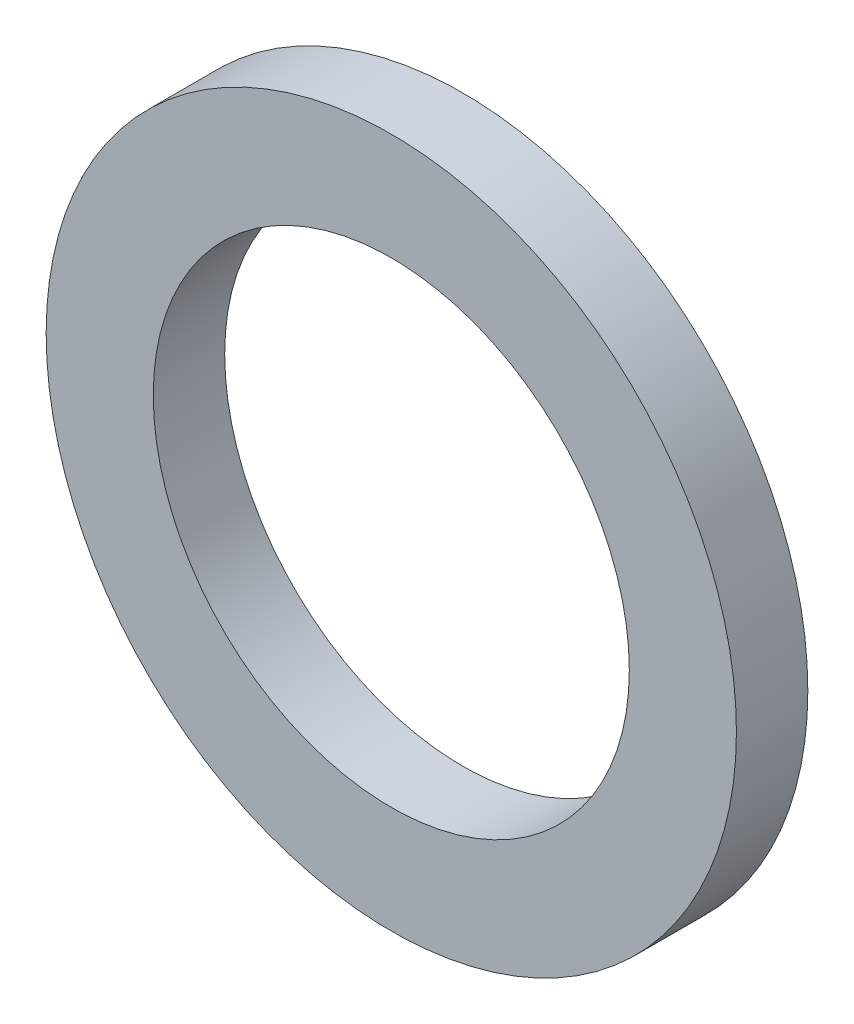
ISO-10303-21;
HEADER;
FILE_DESCRIPTION(('STEP AP214'),'2;1');
FILE_NAME('part.step','',(''),(''),'','','');
FILE_SCHEMA(('AUTOMOTIVE_DESIGN { 1 0 10303 214 1 1 1 1 }'));
ENDSEC;
DATA;
#1=APPLICATION_CONTEXT('core data for automotive mechanical design processes');
#2=APPLICATION_PROTOCOL_DEFINITION('international standard','automotive_design',2000,#1);
#3=PRODUCT_CONTEXT('',#1,'mechanical');
#4=PRODUCT('Part','Part','',(#3));
#5=PRODUCT_RELATED_PRODUCT_CATEGORY('part','',(#4));
#6=PRODUCT_DEFINITION_FORMATION('','',#4);
#7=PRODUCT_DEFINITION_CONTEXT('part definition',#1,'design');
#8=PRODUCT_DEFINITION('design','',#6,#7);
#9=PRODUCT_DEFINITION_SHAPE('','',#8);
#10=(LENGTH_UNIT() NAMED_UNIT(*) SI_UNIT(.MILLI.,.METRE.));
#11=(NAMED_UNIT(*) PLANE_ANGLE_UNIT() SI_UNIT($,.RADIAN.));
#12=(NAMED_UNIT(*) SI_UNIT($,.STERADIAN.) SOLID_ANGLE_UNIT());
#13=UNCERTAINTY_MEASURE_WITH_UNIT(LENGTH_MEASURE(1.E-05),#10,'distance_accuracy_value','');
#14=(GEOMETRIC_REPRESENTATION_CONTEXT(3) GLOBAL_UNCERTAINTY_ASSIGNED_CONTEXT((#13)) GLOBAL_UNIT_ASSIGNED_CONTEXT((#10,
#11,#12)) REPRESENTATION_CONTEXT('',''));
#15=CARTESIAN_POINT('',(0.,0.,0.));
#16=DIRECTION('',(0.,0.,1.));
#17=DIRECTION('',(1.,0.,0.));
#18=AXIS2_PLACEMENT_3D('',#15,#16,#17);
#19=CARTESIAN_POINT('',(-2.22044604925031E-13,-4.9960036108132E-13,1.49999999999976));
#20=DIRECTION('',(0.,0.,1.00000000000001));
#21=DIRECTION('',(1.00000000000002,0.,0.));
#22=AXIS2_PLACEMENT_3D('',#19,#20,#21);
#23=PLANE('',#22);
#24=CARTESIAN_POINT('',(-2.22044604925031E-13,-4.9960036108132E-13,1.49999999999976));
#25=DIRECTION('',(0.,0.,1.00000000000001));
#26=DIRECTION('',(1.00000000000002,0.,0.));
#27=AXIS2_PLACEMENT_3D('',#24,#25,#26);
#28=CIRCLE('',#27,7.25);
#29=CARTESIAN_POINT('',(7.24999999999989,-5.21131748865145E-13,1.49999999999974));
#30=VERTEX_POINT('',#29);
#31=EDGE_CURVE('E10',#30,#30,#28,.T.);
#32=ORIENTED_EDGE('',*,*,#31,.T.);
#33=EDGE_LOOP('',(#32));
#34=FACE_BOUND('',#33,.T.);
#35=CARTESIAN_POINT('',(-2.22044604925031E-13,-4.9960036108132E-13,1.49999999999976));
#36=DIRECTION('',(0.,0.,1.00000000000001));
#37=DIRECTION('',(1.00000000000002,0.,0.));
#38=AXIS2_PLACEMENT_3D('',#35,#36,#37);
#39=CIRCLE('',#38,5.);
#40=CARTESIAN_POINT('',(4.99999999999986,-5.14449594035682E-13,1.49999999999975));
#41=VERTEX_POINT('',#40);
#42=EDGE_CURVE('E31',#41,#41,#39,.T.);
#43=ORIENTED_EDGE('',*,*,#42,.F.);
#44=EDGE_LOOP('',(#43));
#45=FACE_BOUND('',#44,.T.);
#46=ADVANCED_FACE('F20',(#34,#45),#23,.T.);
#47=CARTESIAN_POINT('',(0.,0.,0.));
#48=DIRECTION('',(0.,0.,1.00000000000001));
#49=DIRECTION('',(1.00000000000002,0.,0.));
#50=AXIS2_PLACEMENT_3D('',#47,#48,#49);
#51=PLANE('',#50);
#52=CARTESIAN_POINT('',(0.,0.,0.));
#53=DIRECTION('',(0.,0.,1.00000000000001));
#54=DIRECTION('',(1.00000000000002,0.,0.));
#55=AXIS2_PLACEMENT_3D('',#52,#53,#54);
#56=CIRCLE('',#55,7.25);
#57=CARTESIAN_POINT('',(7.2500000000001,0.,0.));
#58=VERTEX_POINT('',#57);
#59=EDGE_CURVE('E27',#58,#58,#56,.T.);
#60=ORIENTED_EDGE('',*,*,#59,.F.);
#61=EDGE_LOOP('',(#60));
#62=FACE_BOUND('',#61,.T.);
#63=CARTESIAN_POINT('',(0.,0.,0.));
#64=DIRECTION('',(0.,0.,1.00000000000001));
#65=DIRECTION('',(1.00000000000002,0.,0.));
#66=AXIS2_PLACEMENT_3D('',#63,#64,#65);
#67=CIRCLE('',#66,5.);
#68=CARTESIAN_POINT('',(5.00000000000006,0.,0.));
#69=VERTEX_POINT('',#68);
#70=EDGE_CURVE('E35',#69,#69,#67,.T.);
#71=ORIENTED_EDGE('',*,*,#70,.T.);
#72=EDGE_LOOP('',(#71));
#73=FACE_BOUND('',#72,.T.);
#74=ADVANCED_FACE('F41',(#62,#73),#51,.F.);
#75=CARTESIAN_POINT('',(-2.22044604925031E-13,-4.9960036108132E-13,1.49999999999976));
#76=DIRECTION('',(0.,0.,-1.00000000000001));
#77=DIRECTION('',(-1.00000000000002,0.,0.));
#78=AXIS2_PLACEMENT_3D('',#75,#76,#77);
#79=CYLINDRICAL_SURFACE('',#78,7.25);
#80=ORIENTED_EDGE('',*,*,#31,.F.);
#81=EDGE_LOOP('',(#80));
#82=FACE_BOUND('',#81,.T.);
#83=ORIENTED_EDGE('',*,*,#59,.T.);
#84=EDGE_LOOP('',(#83));
#85=FACE_BOUND('',#84,.T.);
#86=ADVANCED_FACE('F22',(#82,#85),#79,.T.);
#87=CARTESIAN_POINT('',(-2.22044604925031E-13,-4.9960036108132E-13,1.49999999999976));
#88=DIRECTION('',(0.,0.,-1.00000000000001));
#89=DIRECTION('',(-1.00000000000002,0.,0.));
#90=AXIS2_PLACEMENT_3D('',#87,#88,#89);
#91=CYLINDRICAL_SURFACE('',#90,5.);
#92=ORIENTED_EDGE('',*,*,#42,.T.);
#93=EDGE_LOOP('',(#92));
#94=FACE_BOUND('',#93,.T.);
#95=ORIENTED_EDGE('',*,*,#70,.F.);
#96=EDGE_LOOP('',(#95));
#97=FACE_BOUND('',#96,.T.);
#98=ADVANCED_FACE('F43',(#94,#97),#91,.F.);
#99=CLOSED_SHELL('',(#46,#74,#86,#98));
#100=MANIFOLD_SOLID_BREP('B2',#99);
#101=ADVANCED_BREP_SHAPE_REPRESENTATION('',(#18,#100),#14);
#102=SHAPE_DEFINITION_REPRESENTATION(#9,#101);
ENDSEC;
END-ISO-10303-21;
